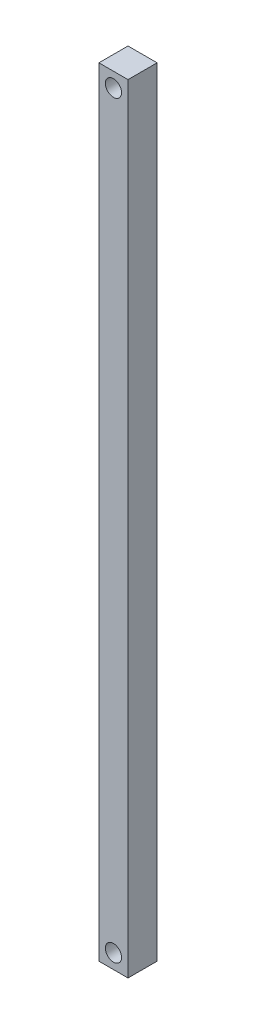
from build123d import *

# Parameters (mm, degrees)
SKETCH1_W           = 18.7
SKETCH1_H           = 500
SKETCH1_R           = 5.2
BOSS_EXTRUDE1_DEPTH = 18.7


with BuildPart() as part:
    # Sketch1 → Boss-Extrude1 (new body)
    with BuildSketch(Plane.XY):
        with Locations((5.58034328, 250)):
            Rectangle(SKETCH1_W, SKETCH1_H)
        with Locations((5.58034328, 490.65)):
            Circle(SKETCH1_R, mode=Mode.SUBTRACT)
        with Locations((5.58034328, 9.35)):
            Circle(SKETCH1_R, mode=Mode.SUBTRACT)
    extrude(amount=BOSS_EXTRUDE1_DEPTH)


solid = part.part
